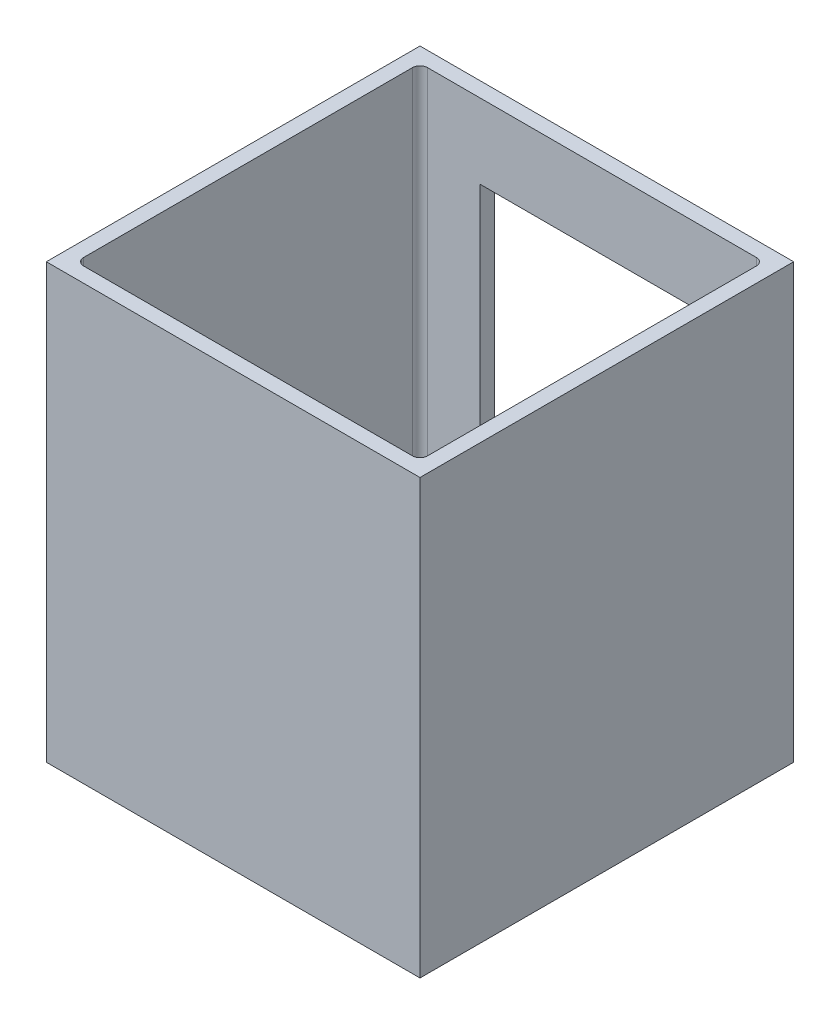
from build123d import *

# Parameters (mm, degrees)
SKETCH2_W           = 63.5
SKETCH2_H           = 63.5
BOSS_EXTRUDE2_DEPTH = 304.8
SKETCH3_W           = 58.42
SKETCH3_H           = 58.42
CUT_EXTRUDE2_DEPTH  = 302.26
SKETCH5_W           = 63.5
SKETCH5_H           = 63.5
CUT_EXTRUDE3_DEPTH  = 2.54
SKETCH6_R           = 12.7
CUT_EXTRUDE4_DEPTH  = 12.7
SKETCH11_R          = 12.7
CUT_EXTRUDE7_DEPTH  = 2.54
CUT_EXTRUDE8_DEPTH  = 2.54
SKETCH14_W          = 38.1
SKETCH14_H          = 276.86
CUT_EXTRUDE9_DEPTH  = 2.54
FILLET1_R           = 1.27
SKETCH17_W          = 63.5
SKETCH17_H          = 63.5
CUT_EXTRUDE10_DEPTH = 228.6
SKETCH18_R          = 1.651
BOSS_EXTRUDE3_DEPTH = 3.81


with BuildPart() as part:
    # Sketch2 → Boss-Extrude2 (new body)
    with BuildSketch(Plane(origin=(0, 0, 0), x_dir=(1, 0, 0), z_dir=(0, 1, 0))):
        with Locations((31.75, 31.75)):
            Rectangle(SKETCH2_W, SKETCH2_H)
    extrude(amount=-BOSS_EXTRUDE2_DEPTH)

    # Sketch3 → Cut-Extrude2 (cut)
    with BuildSketch(Plane(origin=(0, 0, 0), x_dir=(1, 0, 0), z_dir=(0, 1, 0))):
        with Locations((31.75, 31.75)):
            Rectangle(SKETCH3_W, SKETCH3_H)
    extrude(amount=-CUT_EXTRUDE2_DEPTH, mode=Mode.SUBTRACT)

    # Sketch5 → Cut-Extrude3 (cut)
    with BuildSketch(Plane(origin=(0, 0, 0), x_dir=(1, 0, 0), z_dir=(0, 1, 0))):
        with Locations((31.75, 31.75)):
            Rectangle(SKETCH5_W, SKETCH5_H)
    extrude(amount=-CUT_EXTRUDE3_DEPTH, mode=Mode.SUBTRACT)

    # Sketch6 → Cut-Extrude4 (cut)
    with BuildSketch(Plane.XY):
        with Locations((31.75, -152.4)):
            Circle(SKETCH6_R)
    extrude(amount=-CUT_EXTRUDE4_DEPTH, mode=Mode.SUBTRACT)

    # Sketch11 → Cut-Extrude7 (cut)
    with BuildSketch(Plane.XY):
        with BuildLine():
            ThreePointArc((19.453277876, -155.575), (19.151222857, -154.000254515), (19.05, -152.4))
            Line((19.05, -152.4), (19.05, -158.75))
            ThreePointArc((19.05, -158.75), (19.151222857, -157.149745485), (19.453277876, -155.575))
        make_face()
        with Locations((31.75, -158.75)):
            Circle(SKETCH11_R)
        with Locations((31.75, -152.4)):
            Circle(SKETCH11_R)
        with BuildLine():
            Line((44.45, -158.75), (44.45, -152.4))
            ThreePointArc((44.45, -152.4), (44.348777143, -154.000254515), (44.046722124, -155.575))
            ThreePointArc((44.046722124, -155.575), (44.348777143, -157.149745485), (44.45, -158.75))
        make_face()
    extrude(amount=-CUT_EXTRUDE7_DEPTH, mode=Mode.SUBTRACT)

    # Sketch12 → Cut-Extrude8 (cut)
    with BuildSketch(Plane.XY):
        with BuildLine():
            ThreePointArc((44.45, -146.05), (31.75, -133.35), (19.05, -146.05))
            ThreePointArc((19.05, -146.05), (19.151222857, -147.650254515), (19.453277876, -149.225))
            ThreePointArc((19.453277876, -149.225), (31.75, -139.7), (44.046722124, -149.225))
            ThreePointArc((44.046722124, -149.225), (44.348777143, -147.650254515), (44.45, -146.05))
        make_face()
        with BuildLine():
            ThreePointArc((19.453277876, -149.225), (19.151222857, -147.650254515), (19.05, -146.05))
            Line((19.05, -146.05), (19.05, -152.4))
            ThreePointArc((19.05, -152.4), (19.151222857, -150.799745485), (19.453277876, -149.225))
        make_face()
        with BuildLine():
            Line((44.45, -152.4), (44.45, -146.05))
            ThreePointArc((44.45, -146.05), (44.348777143, -147.650254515), (44.046722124, -149.225))
            ThreePointArc((44.046722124, -149.225), (44.348777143, -150.799745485), (44.45, -152.4))
        make_face()
    extrude(amount=-CUT_EXTRUDE8_DEPTH, mode=Mode.SUBTRACT)

    # Sketch14 → Cut-Extrude9 (cut)
    with BuildSketch(Plane(origin=(0, 0, -63.5), x_dir=(-1, 0, 0), z_dir=(0, 0, -1))):
        with Locations((-31.75, -153.67)):
            Rectangle(SKETCH14_W, SKETCH14_H)
    extrude(amount=-CUT_EXTRUDE9_DEPTH, mode=Mode.SUBTRACT)

    # Fillet1
    fillet1_edges = [part.edges().sort_by_distance(p)[0] for p in [
        (60.96, -152.4, -2.54),
        (2.54, -152.4, -2.54),
        (2.54, -152.4, -60.96),
        (60.96, -152.4, -60.96),
    ]]
    fillet(fillet1_edges, radius=FILLET1_R)

    # Sketch17 → Cut-Extrude10 (cut)
    with BuildSketch(Plane.XZ.offset(304.8)):
        with Locations((31.75, -31.75)):
            Rectangle(SKETCH17_W, SKETCH17_H)
    extrude(amount=-CUT_EXTRUDE10_DEPTH, mode=Mode.SUBTRACT)

    # Sketch18 → Boss-Extrude3 (add)
    # profile 1 of 4: a face of its own
    with BuildSketch(Plane.XZ.offset(76.2)):
        with BuildLine():
            Line((2.54, -3.81), (2.54, -7.62))
            Line((2.54, -7.62), (7.62, -7.62))
            Line((7.62, -7.62), (7.62, -2.54))
            Line((7.62, -2.54), (3.81, -2.54))
            ThreePointArc((3.81, -2.54), (2.911974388, -2.911974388), (2.54, -3.81))
        make_face()
        with Locations(Location((5.08, -5.08, 0), (0, 0, 270))):
            Circle(SKETCH18_R, mode=Mode.SUBTRACT)
    # profile 2 of 4: a face of its own
    with BuildSketch(Plane.XZ.offset(76.2)):
        with BuildLine():
            Line((59.69, -2.54), (55.88, -2.54))
            Line((55.88, -2.54), (55.88, -7.62))
            Line((55.88, -7.62), (60.96, -7.62))
            Line((60.96, -7.62), (60.96, -3.81))
            ThreePointArc((60.96, -3.81), (60.588025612, -2.911974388), (59.69, -2.54))
        make_face()
        with Locations(Location((58.42, -5.08, 0), (0, 0, 270))):
            Circle(SKETCH18_R, mode=Mode.SUBTRACT)
    # profile 3 of 4: a face of its own
    with BuildSketch(Plane.XZ.offset(76.2)):
        with BuildLine():
            Line((60.96, -59.69), (60.96, -55.88))
            Line((60.96, -55.88), (55.88, -55.88))
            Line((55.88, -55.88), (55.88, -60.96))
            Line((55.88, -60.96), (59.69, -60.96))
            ThreePointArc((59.69, -60.96), (60.588025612, -60.588025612), (60.96, -59.69))
        make_face()
        with Locations(Location((58.42, -58.42, 0), (0, 0, 270))):
            Circle(SKETCH18_R, mode=Mode.SUBTRACT)
    # profile 4 of 4: a face of its own
    with BuildSketch(Plane.XZ.offset(76.2)):
        with BuildLine():
            ThreePointArc((2.54, -59.69), (2.911974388, -60.588025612), (3.81, -60.96))
            Line((3.81, -60.96), (7.62, -60.96))
            Line((7.62, -60.96), (7.62, -55.88))
            Line((7.62, -55.88), (2.54, -55.88))
            Line((2.54, -55.88), (2.54, -59.69))
        make_face()
        with Locations(Location((5.08, -58.42, 0), (0, 0, 270))):
            Circle(SKETCH18_R, mode=Mode.SUBTRACT)
    extrude(amount=-BOSS_EXTRUDE3_DEPTH)


solid = part.part
